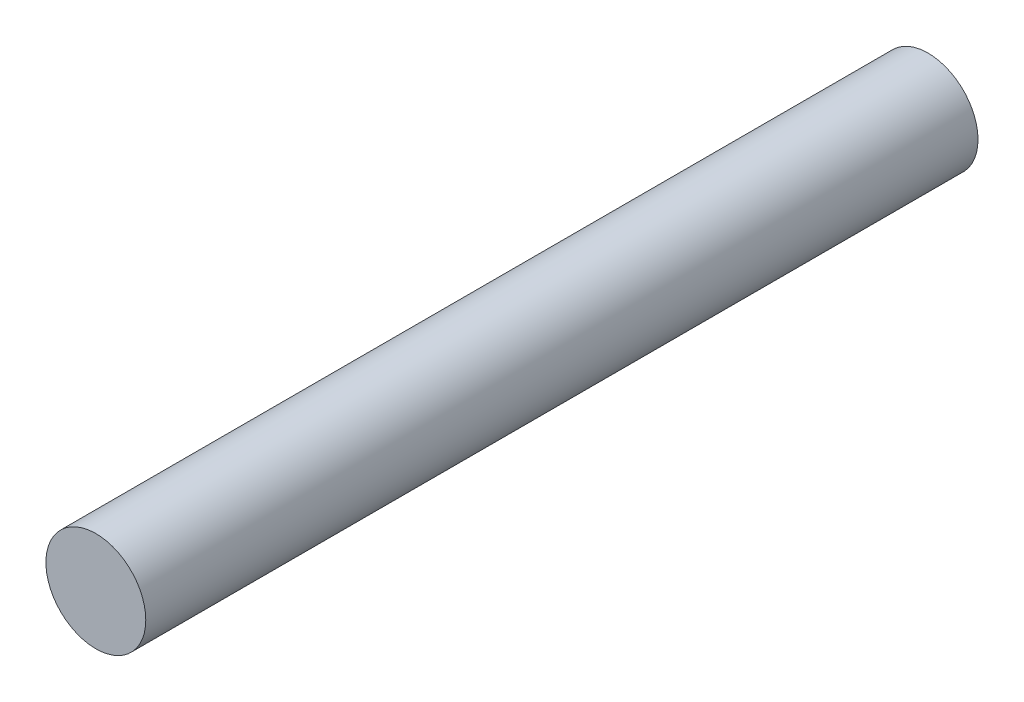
from build123d import *

# Parameters (mm, degrees)
ESQUISSE1_R        = 1.5
BOSS_EXTRU_1_DEPTH = 25


with BuildPart() as part:
    # Esquisse1 → Boss.-Extru.1 (new body)
    with BuildSketch(Plane.XY):
        Circle(ESQUISSE1_R)
    extrude(amount=BOSS_EXTRU_1_DEPTH)


solid = part.part
